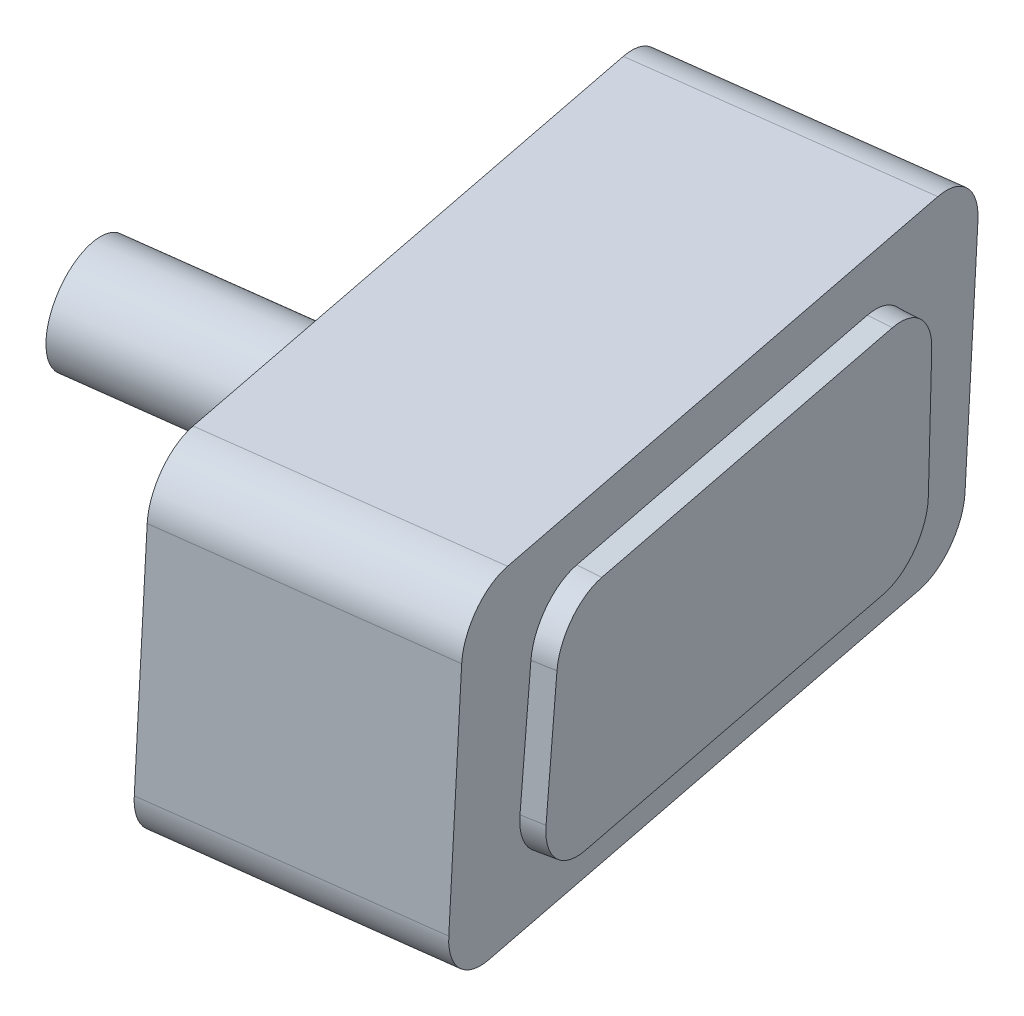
ISO-10303-21;
HEADER;
FILE_DESCRIPTION(('STEP AP214'),'2;1');
FILE_NAME('part.step','',(''),(''),'','','');
FILE_SCHEMA(('AUTOMOTIVE_DESIGN { 1 0 10303 214 1 1 1 1 }'));
ENDSEC;
DATA;
#1=APPLICATION_CONTEXT('core data for automotive mechanical design processes');
#2=APPLICATION_PROTOCOL_DEFINITION('international standard','automotive_design',2000,#1);
#3=PRODUCT_CONTEXT('',#1,'mechanical');
#4=PRODUCT('Part','Part','',(#3));
#5=PRODUCT_RELATED_PRODUCT_CATEGORY('part','',(#4));
#6=PRODUCT_DEFINITION_FORMATION('','',#4);
#7=PRODUCT_DEFINITION_CONTEXT('part definition',#1,'design');
#8=PRODUCT_DEFINITION('design','',#6,#7);
#9=PRODUCT_DEFINITION_SHAPE('','',#8);
#10=(LENGTH_UNIT() NAMED_UNIT(*) SI_UNIT(.MILLI.,.METRE.));
#11=(NAMED_UNIT(*) PLANE_ANGLE_UNIT() SI_UNIT($,.RADIAN.));
#12=(NAMED_UNIT(*) SI_UNIT($,.STERADIAN.) SOLID_ANGLE_UNIT());
#13=UNCERTAINTY_MEASURE_WITH_UNIT(LENGTH_MEASURE(1.E-05),#10,'distance_accuracy_value','');
#14=(GEOMETRIC_REPRESENTATION_CONTEXT(3) GLOBAL_UNCERTAINTY_ASSIGNED_CONTEXT((#13)) GLOBAL_UNIT_ASSIGNED_CONTEXT((#10,
#11,#12)) REPRESENTATION_CONTEXT('',''));
#15=CARTESIAN_POINT('',(0.,0.,0.));
#16=DIRECTION('',(0.,0.,1.));
#17=DIRECTION('',(1.,0.,0.));
#18=AXIS2_PLACEMENT_3D('',#15,#16,#17);
#19=CARTESIAN_POINT('',(-186.967647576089,90.0851409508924,-29.5540646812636));
#20=DIRECTION('',(-0.981314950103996,0.0523359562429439,0.185153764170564));
#21=DIRECTION('',(0.185407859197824,0.,0.982661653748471));
#22=AXIS2_PLACEMENT_3D('',#19,#20,#21);
#23=PLANE('',#22);
#24=CARTESIAN_POINT('',(-186.967647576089,90.0851409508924,-29.5540646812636));
#25=DIRECTION('',(-0.981314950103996,0.0523359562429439,0.185153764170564));
#26=DIRECTION('',(0.185407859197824,0.,0.982661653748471));
#27=AXIS2_PLACEMENT_3D('',#24,#25,#26);
#28=CIRCLE('',#27,9.99999999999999);
#29=CARTESIAN_POINT('',(-188.816557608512,90.1837479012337,-39.3811603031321));
#30=VERTEX_POINT('',#29);
#31=CARTESIAN_POINT('',(-187.500215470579,80.0993324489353,-29.5540646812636));
#32=VERTEX_POINT('',#31);
#33=EDGE_CURVE('E170',#30,#32,#28,.T.);
#34=ORIENTED_EDGE('',*,*,#33,.F.);
#35=DIRECTION('',(-0.0532567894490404,-0.998580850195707,0.));
#36=VECTOR('',#35,1.);
#37=CARTESIAN_POINT('',(-186.420002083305,135.11988616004,-39.3811603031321));
#38=LINE('',#37,#36);
#39=CARTESIAN_POINT('',(-186.420002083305,135.11988616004,-39.3811603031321));
#40=VERTEX_POINT('',#39);
#41=EDGE_CURVE('E216',#40,#30,#38,.T.);
#42=ORIENTED_EDGE('',*,*,#41,.F.);
#43=CARTESIAN_POINT('',(-184.571092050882,135.021279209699,-29.5540646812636));
#44=DIRECTION('',(-0.981314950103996,0.0523359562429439,0.185153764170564));
#45=DIRECTION('',(0.185407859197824,0.,0.982661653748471));
#46=AXIS2_PLACEMENT_3D('',#43,#44,#45);
#47=CIRCLE('',#46,10.);
#48=CARTESIAN_POINT('',(-184.038524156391,145.007087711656,-29.5540646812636));
#49=VERTEX_POINT('',#48);
#50=EDGE_CURVE('E240',#49,#40,#47,.T.);
#51=ORIENTED_EDGE('',*,*,#50,.F.);
#52=DIRECTION('',(-0.184891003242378,0.00986069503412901,-0.98270956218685));
#53=VECTOR('',#52,1.);
#54=CARTESIAN_POINT('',(-184.038524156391,145.007087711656,-29.5540646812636));
#55=LINE('',#54,#53);
#56=CARTESIAN_POINT('',(-165.549423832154,144.021018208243,68.7168915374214));
#57=VERTEX_POINT('',#56);
#58=EDGE_CURVE('E238',#57,#49,#55,.T.);
#59=ORIENTED_EDGE('',*,*,#58,.F.);
#60=CARTESIAN_POINT('',(-166.081991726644,134.035209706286,68.7168915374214));
#61=DIRECTION('',(-0.981314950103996,0.0523359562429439,0.185153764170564));
#62=DIRECTION('',(-0.185407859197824,0.,-0.982661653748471));
#63=AXIS2_PLACEMENT_3D('',#60,#61,#62);
#64=CIRCLE('',#63,10.);
#65=CARTESIAN_POINT('',(-164.23308169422,133.936602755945,78.5439871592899));
#66=VERTEX_POINT('',#65);
#67=EDGE_CURVE('E236',#66,#57,#64,.T.);
#68=ORIENTED_EDGE('',*,*,#67,.F.);
#69=DIRECTION('',(0.053256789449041,0.998580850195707,0.));
#70=VECTOR('',#69,1.);
#71=CARTESIAN_POINT('',(-164.23308169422,133.936602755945,78.5439871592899));
#72=LINE('',#71,#70);
#73=CARTESIAN_POINT('',(-166.629637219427,89.0004644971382,78.5439871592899));
#74=VERTEX_POINT('',#73);
#75=EDGE_CURVE('E234',#74,#66,#72,.T.);
#76=ORIENTED_EDGE('',*,*,#75,.F.);
#77=CARTESIAN_POINT('',(-168.478547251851,89.0990714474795,68.7168915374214));
#78=DIRECTION('',(-0.981314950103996,0.0523359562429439,0.185153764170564));
#79=DIRECTION('',(0.185407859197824,0.,0.982661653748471));
#80=AXIS2_PLACEMENT_3D('',#77,#78,#79);
#81=CIRCLE('',#80,9.99999999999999);
#82=CARTESIAN_POINT('',(-169.011115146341,79.1132629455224,68.7168915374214));
#83=VERTEX_POINT('',#82);
#84=EDGE_CURVE('E232',#83,#74,#81,.T.);
#85=ORIENTED_EDGE('',*,*,#84,.F.);
#86=DIRECTION('',(0.184891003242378,-0.00986069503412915,0.98270956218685));
#87=VECTOR('',#86,1.);
#88=CARTESIAN_POINT('',(-187.500215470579,80.0993324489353,-29.5540646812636));
#89=LINE('',#88,#87);
#90=EDGE_CURVE('E173',#32,#83,#89,.T.);
#91=ORIENTED_EDGE('',*,*,#90,.F.);
#92=EDGE_LOOP('',(#34,#42,#51,#59,#68,#76,#85,#91));
#93=FACE_BOUND('',#92,.T.);
#94=CARTESIAN_POINT('',(-182.195634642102,124.880378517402,-14.0976918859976));
#95=DIRECTION('',(0.981314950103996,-0.0523359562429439,-0.185153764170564));
#96=DIRECTION('',(-0.185407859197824,0.,-0.982661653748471));
#97=AXIS2_PLACEMENT_3D('',#94,#95,#96);
#98=CIRCLE('',#97,9.99999999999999);
#99=CARTESIAN_POINT('',(-184.024832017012,125.327425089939,-23.9188011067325));
#100=VERTEX_POINT('',#99);
#101=CARTESIAN_POINT('',(-181.663066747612,134.866187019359,-14.0976918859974));
#102=VERTEX_POINT('',#101);
#103=EDGE_CURVE('E178',#100,#102,#98,.T.);
#104=ORIENTED_EDGE('',*,*,#103,.F.);
#105=DIRECTION('',(0.0596769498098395,0.997628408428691,0.0342960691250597));
#106=VECTOR('',#105,1.);
#107=CARTESIAN_POINT('',(-185.517665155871,100.371512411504,-24.7767254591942));
#108=LINE('',#107,#106);
#109=CARTESIAN_POINT('',(-185.517665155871,100.371512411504,-24.7767254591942));
#110=VERTEX_POINT('',#109);
#111=EDGE_CURVE('E154',#110,#100,#108,.T.);
#112=ORIENTED_EDGE('',*,*,#111,.F.);
#113=CARTESIAN_POINT('',(-183.688467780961,99.924465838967,-14.9556162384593));
#114=DIRECTION('',(0.981314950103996,-0.0523359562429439,-0.185153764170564));
#115=DIRECTION('',(-0.185407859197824,0.,-0.982661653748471));
#116=AXIS2_PLACEMENT_3D('',#113,#114,#115);
#117=CIRCLE('',#116,10.);
#118=CARTESIAN_POINT('',(-184.221035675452,89.9386573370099,-14.9556162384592));
#119=VERTEX_POINT('',#118);
#120=EDGE_CURVE('E151',#119,#110,#117,.T.);
#121=ORIENTED_EDGE('',*,*,#120,.F.);
#122=DIRECTION('',(-0.184891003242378,0.00986069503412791,-0.98270956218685));
#123=VECTOR('',#122,1.);
#124=CARTESIAN_POINT('',(-171.41005015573,89.2554157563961,53.13573353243));
#125=LINE('',#124,#123);
#126=CARTESIAN_POINT('',(-171.41005015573,89.2554157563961,53.13573353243));
#127=VERTEX_POINT('',#126);
#128=EDGE_CURVE('E207',#127,#119,#125,.T.);
#129=ORIENTED_EDGE('',*,*,#128,.F.);
#130=CARTESIAN_POINT('',(-170.87748226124,99.2412242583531,53.1357335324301));
#131=DIRECTION('',(0.981314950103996,-0.0523359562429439,-0.185153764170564));
#132=DIRECTION('',(-0.185407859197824,0.,-0.982661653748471));
#133=AXIS2_PLACEMENT_3D('',#130,#131,#132);
#134=CIRCLE('',#133,9.9999999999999);
#135=CARTESIAN_POINT('',(-169.011112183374,99.4911770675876,62.9568427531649));
#136=VERTEX_POINT('',#135);
#137=EDGE_CURVE('E203',#136,#127,#134,.T.);
#138=ORIENTED_EDGE('',*,*,#137,.F.);
#139=DIRECTION('',(-0.0467717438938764,-0.998316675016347,0.0342960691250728));
#140=VECTOR('',#139,1.);
#141=CARTESIAN_POINT('',(-167.841105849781,124.464306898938,62.0989184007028));
#142=LINE('',#141,#140);
#143=CARTESIAN_POINT('',(-167.841105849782,124.464306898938,62.0989184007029));
#144=VERTEX_POINT('',#143);
#145=EDGE_CURVE('E199',#144,#136,#142,.T.);
#146=ORIENTED_EDGE('',*,*,#145,.F.);
#147=CARTESIAN_POINT('',(-169.707475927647,124.214354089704,52.277809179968));
#148=DIRECTION('',(0.981314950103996,-0.0523359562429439,-0.185153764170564));
#149=DIRECTION('',(-0.185407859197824,0.,-0.982661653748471));
#150=AXIS2_PLACEMENT_3D('',#147,#148,#149);
#151=CIRCLE('',#150,9.99999999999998);
#152=CARTESIAN_POINT('',(-169.174908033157,134.200162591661,52.2778091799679));
#153=VERTEX_POINT('',#152);
#154=EDGE_CURVE('E52',#153,#144,#151,.T.);
#155=ORIENTED_EDGE('',*,*,#154,.F.);
#156=DIRECTION('',(0.184891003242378,-0.00986069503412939,0.98270956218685));
#157=VECTOR('',#156,1.);
#158=CARTESIAN_POINT('',(-181.663066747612,134.866187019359,-14.0976918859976));
#159=LINE('',#158,#157);
#160=EDGE_CURVE('E47',#102,#153,#159,.T.);
#161=ORIENTED_EDGE('',*,*,#160,.F.);
#162=EDGE_LOOP('',(#104,#112,#121,#129,#138,#146,#155,#161));
#163=FACE_BOUND('',#162,.T.);
#164=ADVANCED_FACE('F32',(#93,#163),#23,.F.);
#165=CARTESIAN_POINT('',(-236.033395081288,92.7019387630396,-20.2963764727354));
#166=DIRECTION('',(0.981314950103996,-0.0523359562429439,-0.185153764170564));
#167=DIRECTION('',(-0.185407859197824,0.,-0.982661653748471));
#168=AXIS2_PLACEMENT_3D('',#165,#166,#167);
#169=CYLINDRICAL_SURFACE('',#168,9.99999999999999);
#170=ORIENTED_EDGE('',*,*,#33,.T.);
#171=DIRECTION('',(0.981314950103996,-0.0523359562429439,-0.185153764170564));
#172=VECTOR('',#171,1.);
#173=CARTESIAN_POINT('',(-236.565962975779,82.7161302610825,-20.2963764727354));
#174=LINE('',#173,#172);
#175=CARTESIAN_POINT('',(-236.565962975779,82.7161302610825,-20.2963764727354));
#176=VERTEX_POINT('',#175);
#177=EDGE_CURVE('E11',#176,#32,#174,.T.);
#178=ORIENTED_EDGE('',*,*,#177,.F.);
#179=CARTESIAN_POINT('',(-236.033395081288,92.7019387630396,-20.2963764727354));
#180=DIRECTION('',(-0.981314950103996,0.0523359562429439,0.185153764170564));
#181=DIRECTION('',(0.185407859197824,0.,0.982661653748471));
#182=AXIS2_PLACEMENT_3D('',#179,#180,#181);
#183=CIRCLE('',#182,9.99999999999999);
#184=CARTESIAN_POINT('',(-237.882305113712,92.8005457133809,-30.1234720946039));
#185=VERTEX_POINT('',#184);
#186=EDGE_CURVE('E212',#185,#176,#183,.T.);
#187=ORIENTED_EDGE('',*,*,#186,.F.);
#188=DIRECTION('',(0.981314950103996,-0.0523359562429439,-0.185153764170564));
#189=VECTOR('',#188,1.);
#190=CARTESIAN_POINT('',(-237.882305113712,92.8005457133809,-30.1234720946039));
#191=LINE('',#190,#189);
#192=EDGE_CURVE('E229',#185,#30,#191,.T.);
#193=ORIENTED_EDGE('',*,*,#192,.T.);
#194=EDGE_LOOP('',(#170,#178,#187,#193));
#195=FACE_BOUND('',#194,.T.);
#196=ADVANCED_FACE('F34',(#195),#169,.T.);
#197=CARTESIAN_POINT('',(-236.565962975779,82.7161302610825,-20.2963764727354));
#198=DIRECTION('',(0.0532567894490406,0.998580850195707,0.));
#199=DIRECTION('',(-0.998580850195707,0.0532567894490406,0.));
#200=AXIS2_PLACEMENT_3D('',#197,#198,#199);
#201=PLANE('',#200);
#202=ORIENTED_EDGE('',*,*,#90,.T.);
#203=DIRECTION('',(0.981314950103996,-0.0523359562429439,-0.185153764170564));
#204=VECTOR('',#203,1.);
#205=CARTESIAN_POINT('',(-218.076862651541,81.7300607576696,77.9745797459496));
#206=LINE('',#205,#204);
#207=CARTESIAN_POINT('',(-218.076862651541,81.7300607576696,77.9745797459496));
#208=VERTEX_POINT('',#207);
#209=EDGE_CURVE('E40',#208,#83,#206,.T.);
#210=ORIENTED_EDGE('',*,*,#209,.F.);
#211=DIRECTION('',(0.184891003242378,-0.00986069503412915,0.98270956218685));
#212=VECTOR('',#211,1.);
#213=CARTESIAN_POINT('',(-236.565962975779,82.7161302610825,-20.2963764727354));
#214=LINE('',#213,#212);
#215=EDGE_CURVE('E215',#176,#208,#214,.T.);
#216=ORIENTED_EDGE('',*,*,#215,.F.);
#217=ORIENTED_EDGE('',*,*,#177,.T.);
#218=EDGE_LOOP('',(#202,#210,#216,#217));
#219=FACE_BOUND('',#218,.T.);
#220=ADVANCED_FACE('F286',(#219),#201,.F.);
#221=CARTESIAN_POINT('',(-217.544294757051,91.7158692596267,77.9745797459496));
#222=DIRECTION('',(0.981314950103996,-0.0523359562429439,-0.185153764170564));
#223=DIRECTION('',(-0.185407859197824,0.,-0.982661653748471));
#224=AXIS2_PLACEMENT_3D('',#221,#222,#223);
#225=CYLINDRICAL_SURFACE('',#224,9.99999999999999);
#226=ORIENTED_EDGE('',*,*,#84,.T.);
#227=DIRECTION('',(0.981314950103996,-0.0523359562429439,-0.185153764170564));
#228=VECTOR('',#227,1.);
#229=CARTESIAN_POINT('',(-215.695384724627,91.6172623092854,87.8016753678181));
#230=LINE('',#229,#228);
#231=CARTESIAN_POINT('',(-215.695384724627,91.6172623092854,87.8016753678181));
#232=VERTEX_POINT('',#231);
#233=EDGE_CURVE('E257',#232,#74,#230,.T.);
#234=ORIENTED_EDGE('',*,*,#233,.F.);
#235=CARTESIAN_POINT('',(-217.544294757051,91.7158692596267,77.9745797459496));
#236=DIRECTION('',(-0.981314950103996,0.0523359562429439,0.185153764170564));
#237=DIRECTION('',(0.185407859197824,0.,0.982661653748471));
#238=AXIS2_PLACEMENT_3D('',#235,#236,#237);
#239=CIRCLE('',#238,9.99999999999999);
#240=EDGE_CURVE('E218',#208,#232,#239,.T.);
#241=ORIENTED_EDGE('',*,*,#240,.F.);
#242=ORIENTED_EDGE('',*,*,#209,.T.);
#243=EDGE_LOOP('',(#226,#234,#241,#242));
#244=FACE_BOUND('',#243,.T.);
#245=ADVANCED_FACE('F264',(#244),#225,.T.);
#246=CARTESIAN_POINT('',(-213.29882919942,136.553400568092,87.8016753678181));
#247=DIRECTION('',(-0.184891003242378,0.00986069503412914,-0.98270956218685));
#248=DIRECTION('',(-0.982757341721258,0.,0.184899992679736));
#249=AXIS2_PLACEMENT_3D('',#246,#247,#248);
#250=PLANE('',#249);
#251=ORIENTED_EDGE('',*,*,#75,.T.);
#252=DIRECTION('',(0.981314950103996,-0.0523359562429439,-0.185153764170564));
#253=VECTOR('',#252,1.);
#254=CARTESIAN_POINT('',(-213.29882919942,136.553400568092,87.8016753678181));
#255=LINE('',#254,#253);
#256=CARTESIAN_POINT('',(-213.29882919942,136.553400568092,87.8016753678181));
#257=VERTEX_POINT('',#256);
#258=EDGE_CURVE('E254',#257,#66,#255,.T.);
#259=ORIENTED_EDGE('',*,*,#258,.F.);
#260=DIRECTION('',(0.053256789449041,0.998580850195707,0.));
#261=VECTOR('',#260,1.);
#262=CARTESIAN_POINT('',(-213.29882919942,136.553400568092,87.8016753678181));
#263=LINE('',#262,#261);
#264=EDGE_CURVE('E220',#232,#257,#263,.T.);
#265=ORIENTED_EDGE('',*,*,#264,.F.);
#266=ORIENTED_EDGE('',*,*,#233,.T.);
#267=EDGE_LOOP('',(#251,#259,#265,#266));
#268=FACE_BOUND('',#267,.T.);
#269=ADVANCED_FACE('F274',(#268),#250,.F.);
#270=CARTESIAN_POINT('',(-215.147739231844,136.652007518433,77.9745797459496));
#271=DIRECTION('',(0.981314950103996,-0.0523359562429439,-0.185153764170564));
#272=DIRECTION('',(-0.185407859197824,0.,-0.982661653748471));
#273=AXIS2_PLACEMENT_3D('',#270,#271,#272);
#274=CYLINDRICAL_SURFACE('',#273,10.);
#275=ORIENTED_EDGE('',*,*,#67,.T.);
#276=DIRECTION('',(0.981314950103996,-0.0523359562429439,-0.185153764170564));
#277=VECTOR('',#276,1.);
#278=CARTESIAN_POINT('',(-214.615171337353,146.637816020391,77.9745797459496));
#279=LINE('',#278,#277);
#280=CARTESIAN_POINT('',(-214.615171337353,146.637816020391,77.9745797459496));
#281=VERTEX_POINT('',#280);
#282=EDGE_CURVE('E251',#281,#57,#279,.T.);
#283=ORIENTED_EDGE('',*,*,#282,.F.);
#284=CARTESIAN_POINT('',(-215.147739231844,136.652007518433,77.9745797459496));
#285=DIRECTION('',(-0.981314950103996,0.0523359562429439,0.185153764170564));
#286=DIRECTION('',(-0.185407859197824,0.,-0.982661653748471));
#287=AXIS2_PLACEMENT_3D('',#284,#285,#286);
#288=CIRCLE('',#287,10.);
#289=EDGE_CURVE('E222',#257,#281,#288,.T.);
#290=ORIENTED_EDGE('',*,*,#289,.F.);
#291=ORIENTED_EDGE('',*,*,#258,.T.);
#292=EDGE_LOOP('',(#275,#283,#290,#291));
#293=FACE_BOUND('',#292,.T.);
#294=ADVANCED_FACE('F278',(#293),#274,.T.);
#295=CARTESIAN_POINT('',(-233.104271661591,147.623885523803,-20.2963764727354));
#296=DIRECTION('',(-0.0532567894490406,-0.998580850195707,0.));
#297=DIRECTION('',(0.998580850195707,-0.0532567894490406,0.));
#298=AXIS2_PLACEMENT_3D('',#295,#296,#297);
#299=PLANE('',#298);
#300=ORIENTED_EDGE('',*,*,#58,.T.);
#301=DIRECTION('',(0.981314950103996,-0.0523359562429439,-0.185153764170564));
#302=VECTOR('',#301,1.);
#303=CARTESIAN_POINT('',(-233.104271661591,147.623885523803,-20.2963764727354));
#304=LINE('',#303,#302);
#305=CARTESIAN_POINT('',(-233.104271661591,147.623885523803,-20.2963764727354));
#306=VERTEX_POINT('',#305);
#307=EDGE_CURVE('E248',#306,#49,#304,.T.);
#308=ORIENTED_EDGE('',*,*,#307,.F.);
#309=DIRECTION('',(-0.184891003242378,0.00986069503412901,-0.98270956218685));
#310=VECTOR('',#309,1.);
#311=CARTESIAN_POINT('',(-233.104271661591,147.623885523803,-20.2963764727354));
#312=LINE('',#311,#310);
#313=EDGE_CURVE('E224',#281,#306,#312,.T.);
#314=ORIENTED_EDGE('',*,*,#313,.F.);
#315=ORIENTED_EDGE('',*,*,#282,.T.);
#316=EDGE_LOOP('',(#300,#308,#314,#315));
#317=FACE_BOUND('',#316,.T.);
#318=ADVANCED_FACE('F299',(#317),#299,.F.);
#319=CARTESIAN_POINT('',(-233.636839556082,137.638077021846,-20.2963764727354));
#320=DIRECTION('',(0.981314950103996,-0.0523359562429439,-0.185153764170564));
#321=DIRECTION('',(-0.185407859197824,0.,-0.982661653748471));
#322=AXIS2_PLACEMENT_3D('',#319,#320,#321);
#323=CYLINDRICAL_SURFACE('',#322,10.);
#324=ORIENTED_EDGE('',*,*,#50,.T.);
#325=DIRECTION('',(0.981314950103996,-0.0523359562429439,-0.185153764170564));
#326=VECTOR('',#325,1.);
#327=CARTESIAN_POINT('',(-235.485749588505,137.736683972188,-30.1234720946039));
#328=LINE('',#327,#326);
#329=CARTESIAN_POINT('',(-235.485749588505,137.736683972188,-30.1234720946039));
#330=VERTEX_POINT('',#329);
#331=EDGE_CURVE('E245',#330,#40,#328,.T.);
#332=ORIENTED_EDGE('',*,*,#331,.F.);
#333=CARTESIAN_POINT('',(-233.636839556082,137.638077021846,-20.2963764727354));
#334=DIRECTION('',(-0.981314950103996,0.0523359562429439,0.185153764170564));
#335=DIRECTION('',(0.185407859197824,0.,0.982661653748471));
#336=AXIS2_PLACEMENT_3D('',#333,#334,#335);
#337=CIRCLE('',#336,10.);
#338=EDGE_CURVE('E226',#306,#330,#337,.T.);
#339=ORIENTED_EDGE('',*,*,#338,.F.);
#340=ORIENTED_EDGE('',*,*,#307,.T.);
#341=EDGE_LOOP('',(#324,#332,#339,#340));
#342=FACE_BOUND('',#341,.T.);
#343=ADVANCED_FACE('F297',(#342),#323,.T.);
#344=CARTESIAN_POINT('',(-235.485749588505,137.736683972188,-30.1234720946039));
#345=DIRECTION('',(0.184891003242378,-0.00986069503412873,0.98270956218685));
#346=DIRECTION('',(0.982757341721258,0.,-0.184899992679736));
#347=AXIS2_PLACEMENT_3D('',#344,#345,#346);
#348=PLANE('',#347);
#349=ORIENTED_EDGE('',*,*,#41,.T.);
#350=ORIENTED_EDGE('',*,*,#192,.F.);
#351=DIRECTION('',(-0.0532567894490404,-0.998580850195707,0.));
#352=VECTOR('',#351,1.);
#353=CARTESIAN_POINT('',(-235.485749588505,137.736683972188,-30.1234720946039));
#354=LINE('',#353,#352);
#355=EDGE_CURVE('E228',#330,#185,#354,.T.);
#356=ORIENTED_EDGE('',*,*,#355,.F.);
#357=ORIENTED_EDGE('',*,*,#331,.T.);
#358=EDGE_LOOP('',(#349,#350,#356,#357));
#359=FACE_BOUND('',#358,.T.);
#360=ADVANCED_FACE('F292',(#359),#348,.F.);
#361=CARTESIAN_POINT('',(-236.033395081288,92.7019387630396,-20.2963764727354));
#362=DIRECTION('',(-0.981314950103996,0.0523359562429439,0.185153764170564));
#363=DIRECTION('',(0.185407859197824,0.,0.982661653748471));
#364=AXIS2_PLACEMENT_3D('',#361,#362,#363);
#365=PLANE('',#364);
#366=CARTESIAN_POINT('',(-225.902382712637,113.03671985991,27.6501166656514));
#367=DIRECTION('',(-0.981314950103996,0.0523359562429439,0.185153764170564));
#368=DIRECTION('',(0.185407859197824,0.,0.982661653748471));
#369=AXIS2_PLACEMENT_3D('',#366,#367,#368);
#370=CIRCLE('',#369,9.99999999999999);
#371=CARTESIAN_POINT('',(-224.048304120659,113.03671985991,37.4767332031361));
#372=VERTEX_POINT('',#371);
#373=EDGE_CURVE('E330',#372,#372,#370,.T.);
#374=ORIENTED_EDGE('',*,*,#373,.F.);
#375=EDGE_LOOP('',(#374));
#376=FACE_BOUND('',#375,.T.);
#377=ORIENTED_EDGE('',*,*,#186,.T.);
#378=ORIENTED_EDGE('',*,*,#215,.T.);
#379=ORIENTED_EDGE('',*,*,#240,.T.);
#380=ORIENTED_EDGE('',*,*,#264,.T.);
#381=ORIENTED_EDGE('',*,*,#289,.T.);
#382=ORIENTED_EDGE('',*,*,#313,.T.);
#383=ORIENTED_EDGE('',*,*,#338,.T.);
#384=ORIENTED_EDGE('',*,*,#355,.T.);
#385=EDGE_LOOP('',(#377,#378,#379,#380,#381,#382,#383,#384));
#386=FACE_BOUND('',#385,.T.);
#387=ADVANCED_FACE('F282',(#376,#386),#365,.T.);
#388=CARTESIAN_POINT('',(-182.195634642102,124.880378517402,-14.0976918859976));
#389=DIRECTION('',(-0.981314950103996,0.0523359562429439,0.185153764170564));
#390=DIRECTION('',(-0.185407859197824,0.,-0.982661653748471));
#391=AXIS2_PLACEMENT_3D('',#388,#389,#390);
#392=CONICAL_SURFACE('',#391,9.99999999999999,0.05235987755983);
#393=CARTESIAN_POINT('',(-178.270374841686,124.67103469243,-14.8383069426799));
#394=DIRECTION('',(-0.981314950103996,0.0523359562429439,0.185153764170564));
#395=DIRECTION('',(0.185407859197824,0.,0.982661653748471));
#396=AXIS2_PLACEMENT_3D('',#393,#394,#395);
#397=CIRCLE('',#396,9.79036888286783);
#398=CARTESIAN_POINT('',(-180.06122654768,125.108709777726,-24.4535351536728));
#399=VERTEX_POINT('',#398);
#400=CARTESIAN_POINT('',(-177.748971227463,134.447509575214,-14.8383069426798));
#401=VERTEX_POINT('',#400);
#402=EDGE_CURVE('E164',#399,#401,#397,.F.);
#403=ORIENTED_EDGE('',*,*,#402,.F.);
#404=DIRECTION('',(-0.989543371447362,0.0546038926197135,0.133500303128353));
#405=VECTOR('',#404,1.);
#406=CARTESIAN_POINT('',(-184.024832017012,125.327425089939,-23.9188011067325));
#407=LINE('',#406,#405);
#408=EDGE_CURVE('E160',#399,#100,#407,.T.);
#409=ORIENTED_EDGE('',*,*,#408,.T.);
#410=ORIENTED_EDGE('',*,*,#103,.T.);
#411=DIRECTION('',(-0.977182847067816,0.104525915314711,0.184900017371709));
#412=VECTOR('',#411,1.);
#413=CARTESIAN_POINT('',(-181.663066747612,134.866187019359,-14.0976918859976));
#414=LINE('',#413,#412);
#415=EDGE_CURVE('E192',#401,#102,#414,.T.);
#416=ORIENTED_EDGE('',*,*,#415,.F.);
#417=EDGE_LOOP('',(#403,#409,#410,#416));
#418=FACE_BOUND('',#417,.T.);
#419=ADVANCED_FACE('F320',(#418),#392,.T.);
#420=CARTESIAN_POINT('',(-181.663066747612,134.866187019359,-14.0976918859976));
#421=DIRECTION('',(0.104541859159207,0.994473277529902,-0.00969019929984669));
#422=DIRECTION('',(-0.994519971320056,0.104546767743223,0.));
#423=AXIS2_PLACEMENT_3D('',#420,#421,#422);
#424=PLANE('',#423);
#425=DIRECTION('',(0.184891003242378,-0.0098606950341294,0.98270956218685));
#426=VECTOR('',#425,1.);
#427=CARTESIAN_POINT('',(-177.748971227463,134.447509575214,-14.8383069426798));
#428=LINE('',#427,#426);
#429=CARTESIAN_POINT('',(-165.260812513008,133.781485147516,51.5371941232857));
#430=VERTEX_POINT('',#429);
#431=EDGE_CURVE('E188',#401,#430,#428,.T.);
#432=ORIENTED_EDGE('',*,*,#431,.F.);
#433=ORIENTED_EDGE('',*,*,#415,.T.);
#434=ORIENTED_EDGE('',*,*,#160,.T.);
#435=DIRECTION('',(-0.977182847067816,0.104525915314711,0.184900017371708));
#436=VECTOR('',#435,1.);
#437=CARTESIAN_POINT('',(-169.174908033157,134.200162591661,52.2778091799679));
#438=LINE('',#437,#436);
#439=EDGE_CURVE('E194',#430,#153,#438,.T.);
#440=ORIENTED_EDGE('',*,*,#439,.F.);
#441=EDGE_LOOP('',(#432,#433,#434,#440));
#442=FACE_BOUND('',#441,.T.);
#443=ADVANCED_FACE('F325',(#442),#424,.T.);
#444=CARTESIAN_POINT('',(-169.707475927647,124.214354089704,52.277809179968));
#445=DIRECTION('',(-0.981314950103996,0.0523359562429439,0.185153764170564));
#446=DIRECTION('',(-0.185407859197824,0.,-0.982661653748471));
#447=AXIS2_PLACEMENT_3D('',#444,#445,#446);
#448=CONICAL_SURFACE('',#447,9.99999999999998,0.05235987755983);
#449=CARTESIAN_POINT('',(-165.782216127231,124.005010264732,51.5371941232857));
#450=DIRECTION('',(-0.981314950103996,0.0523359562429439,0.185153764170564));
#451=DIRECTION('',(0.185407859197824,0.,0.982661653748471));
#452=AXIS2_PLACEMENT_3D('',#449,#450,#451);
#453=CIRCLE('',#452,9.79036888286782);
#454=CARTESIAN_POINT('',(-163.954970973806,124.249723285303,61.1524223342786));
#455=VERTEX_POINT('',#454);
#456=EDGE_CURVE('E185',#430,#455,#453,.F.);
#457=ORIENTED_EDGE('',*,*,#456,.F.);
#458=ORIENTED_EDGE('',*,*,#439,.T.);
#459=ORIENTED_EDGE('',*,*,#154,.T.);
#460=DIRECTION('',(-0.97020226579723,0.0535723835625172,0.236299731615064));
#461=VECTOR('',#460,1.);
#462=CARTESIAN_POINT('',(-167.841105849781,124.464306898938,62.0989184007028));
#463=LINE('',#462,#461);
#464=EDGE_CURVE('E196',#455,#144,#463,.T.);
#465=ORIENTED_EDGE('',*,*,#464,.F.);
#466=EDGE_LOOP('',(#457,#458,#459,#465));
#467=FACE_BOUND('',#466,.T.);
#468=ADVANCED_FACE('F358',(#467),#448,.T.);
#469=CARTESIAN_POINT('',(-167.841105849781,124.464306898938,62.0989184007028));
#470=DIRECTION('',(0.237739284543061,0.0222219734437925,0.971074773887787));
#471=DIRECTION('',(0.971314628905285,0.,-0.237798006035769));
#472=AXIS2_PLACEMENT_3D('',#469,#470,#471);
#473=PLANE('',#472);
#474=DIRECTION('',(-0.0467717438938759,-0.998316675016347,0.0342960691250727));
#475=VECTOR('',#474,1.);
#476=CARTESIAN_POINT('',(-163.954970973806,124.249723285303,61.1524223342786));
#477=LINE('',#476,#475);
#478=CARTESIAN_POINT('',(-165.124977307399,99.2765934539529,62.0103466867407));
#479=VERTEX_POINT('',#478);
#480=EDGE_CURVE('E182',#455,#479,#477,.T.);
#481=ORIENTED_EDGE('',*,*,#480,.F.);
#482=ORIENTED_EDGE('',*,*,#464,.T.);
#483=ORIENTED_EDGE('',*,*,#145,.T.);
#484=DIRECTION('',(-0.97020226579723,0.0535723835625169,0.236299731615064));
#485=VECTOR('',#484,1.);
#486=CARTESIAN_POINT('',(-169.011112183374,99.4911770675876,62.9568427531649));
#487=LINE('',#486,#485);
#488=EDGE_CURVE('E200',#479,#136,#487,.T.);
#489=ORIENTED_EDGE('',*,*,#488,.F.);
#490=EDGE_LOOP('',(#481,#482,#483,#489));
#491=FACE_BOUND('',#490,.T.);
#492=ADVANCED_FACE('F356',(#491),#473,.T.);
#493=CARTESIAN_POINT('',(-170.87748226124,99.2412242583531,53.1357335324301));
#494=DIRECTION('',(-0.981314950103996,0.0523359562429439,0.185153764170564));
#495=DIRECTION('',(-0.185407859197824,0.,-0.982661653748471));
#496=AXIS2_PLACEMENT_3D('',#493,#494,#495);
#497=CONICAL_SURFACE('',#496,9.9999999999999,0.05235987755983);
#498=CARTESIAN_POINT('',(-166.952222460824,99.0318804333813,52.3951184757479));
#499=DIRECTION('',(-0.981314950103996,0.0523359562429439,0.185153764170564));
#500=DIRECTION('',(0.185407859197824,0.,0.982661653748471));
#501=AXIS2_PLACEMENT_3D('',#498,#499,#500);
#502=CIRCLE('',#501,9.79036888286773);
#503=CARTESIAN_POINT('',(-167.473626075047,89.2554055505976,52.3951184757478));
#504=VERTEX_POINT('',#503);
#505=EDGE_CURVE('E175',#479,#504,#502,.F.);
#506=ORIENTED_EDGE('',*,*,#505,.F.);
#507=ORIENTED_EDGE('',*,*,#488,.T.);
#508=ORIENTED_EDGE('',*,*,#137,.T.);
#509=DIRECTION('',(-0.982757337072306,2.54795294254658E-06,0.184900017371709));
#510=VECTOR('',#509,1.);
#511=CARTESIAN_POINT('',(-171.41005015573,89.2554157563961,53.13573353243));
#512=LINE('',#511,#510);
#513=EDGE_CURVE('E204',#504,#127,#512,.T.);
#514=ORIENTED_EDGE('',*,*,#513,.F.);
#515=EDGE_LOOP('',(#506,#507,#508,#514));
#516=FACE_BOUND('',#515,.T.);
#517=ADVANCED_FACE('F352',(#516),#497,.T.);
#518=CARTESIAN_POINT('',(-171.41005015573,89.2554157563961,53.13573353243));
#519=DIRECTION('',(-0.00182574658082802,-0.999951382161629,-0.00969019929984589));
#520=DIRECTION('',(0.,0.00969021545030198,-0.999953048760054));
#521=AXIS2_PLACEMENT_3D('',#518,#519,#520);
#522=PLANE('',#521);
#523=DIRECTION('',(-0.184891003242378,0.0098606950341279,-0.98270956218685));
#524=VECTOR('',#523,1.);
#525=CARTESIAN_POINT('',(-167.473626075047,89.2554055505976,52.3951184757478));
#526=LINE('',#525,#524);
#527=CARTESIAN_POINT('',(-180.284611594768,89.9386471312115,-15.6962312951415));
#528=VERTEX_POINT('',#527);
#529=EDGE_CURVE('E169',#504,#528,#526,.T.);
#530=ORIENTED_EDGE('',*,*,#529,.F.);
#531=ORIENTED_EDGE('',*,*,#513,.T.);
#532=ORIENTED_EDGE('',*,*,#128,.T.);
#533=DIRECTION('',(-0.982757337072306,2.54795294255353E-06,0.184900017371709));
#534=VECTOR('',#533,1.);
#535=CARTESIAN_POINT('',(-184.221035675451,89.9386573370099,-14.9556162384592));
#536=LINE('',#535,#534);
#537=EDGE_CURVE('E208',#528,#119,#536,.T.);
#538=ORIENTED_EDGE('',*,*,#537,.F.);
#539=EDGE_LOOP('',(#530,#531,#532,#538));
#540=FACE_BOUND('',#539,.T.);
#541=ADVANCED_FACE('F349',(#540),#522,.T.);
#542=CARTESIAN_POINT('',(-183.688467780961,99.924465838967,-14.9556162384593));
#543=DIRECTION('',(-0.981314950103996,0.0523359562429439,0.185153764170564));
#544=DIRECTION('',(-0.185407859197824,0.,-0.982661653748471));
#545=AXIS2_PLACEMENT_3D('',#542,#543,#544);
#546=CONICAL_SURFACE('',#545,10.,0.05235987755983);
#547=CARTESIAN_POINT('',(-179.763207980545,99.7151220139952,-15.6962312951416));
#548=DIRECTION('',(-0.981314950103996,0.0523359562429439,0.185153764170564));
#549=DIRECTION('',(0.185407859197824,0.,0.982661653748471));
#550=AXIS2_PLACEMENT_3D('',#547,#548,#549);
#551=CIRCLE('',#550,9.79036888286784);
#552=CARTESIAN_POINT('',(-181.55405968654,100.152797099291,-25.3114595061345));
#553=VERTEX_POINT('',#552);
#554=EDGE_CURVE('E149',#528,#553,#551,.F.);
#555=ORIENTED_EDGE('',*,*,#554,.F.);
#556=ORIENTED_EDGE('',*,*,#537,.T.);
#557=ORIENTED_EDGE('',*,*,#120,.T.);
#558=DIRECTION('',(-0.989543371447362,0.0546038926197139,0.133500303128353));
#559=VECTOR('',#558,1.);
#560=CARTESIAN_POINT('',(-185.517665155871,100.371512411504,-24.7767254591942));
#561=LINE('',#560,#559);
#562=EDGE_CURVE('E144',#553,#110,#561,.T.);
#563=ORIENTED_EDGE('',*,*,#562,.F.);
#564=EDGE_LOOP('',(#555,#556,#557,#563));
#565=FACE_BOUND('',#564,.T.);
#566=ADVANCED_FACE('F146',(#565),#546,.T.);
#567=CARTESIAN_POINT('',(-185.517665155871,100.371512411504,-24.7767254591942));
#568=DIRECTION('',(-0.131310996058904,0.0419043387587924,-0.990455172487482));
#569=DIRECTION('',(-0.991325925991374,0.,0.131426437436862));
#570=AXIS2_PLACEMENT_3D('',#567,#568,#569);
#571=PLANE('',#570);
#572=DIRECTION('',(0.0596769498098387,0.997628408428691,0.0342960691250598));
#573=VECTOR('',#572,1.);
#574=CARTESIAN_POINT('',(-181.55405968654,100.152797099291,-25.3114595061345));
#575=LINE('',#574,#573);
#576=EDGE_CURVE('E157',#553,#399,#575,.T.);
#577=ORIENTED_EDGE('',*,*,#576,.F.);
#578=ORIENTED_EDGE('',*,*,#562,.T.);
#579=ORIENTED_EDGE('',*,*,#111,.T.);
#580=ORIENTED_EDGE('',*,*,#408,.F.);
#581=EDGE_LOOP('',(#577,#578,#579,#580));
#582=FACE_BOUND('',#581,.T.);
#583=ADVANCED_FACE('F158',(#582),#571,.T.);
#584=CARTESIAN_POINT('',(-190.933671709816,24.7906561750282,-53.72138040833));
#585=DIRECTION('',(-0.981314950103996,0.0523359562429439,0.185153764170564));
#586=DIRECTION('',(0.185407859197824,0.,0.982661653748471));
#587=AXIS2_PLACEMENT_3D('',#584,#585,#586);
#588=PLANE('',#587);
#589=ORIENTED_EDGE('',*,*,#576,.T.);
#590=ORIENTED_EDGE('',*,*,#402,.T.);
#591=ORIENTED_EDGE('',*,*,#431,.T.);
#592=ORIENTED_EDGE('',*,*,#456,.T.);
#593=ORIENTED_EDGE('',*,*,#480,.T.);
#594=ORIENTED_EDGE('',*,*,#505,.T.);
#595=ORIENTED_EDGE('',*,*,#529,.T.);
#596=ORIENTED_EDGE('',*,*,#554,.T.);
#597=EDGE_LOOP('',(#589,#590,#591,#592,#593,#594,#595,#596));
#598=FACE_BOUND('',#597,.T.);
#599=ADVANCED_FACE('F167',(#598),#588,.F.);
#600=CARTESIAN_POINT('',(-274.968130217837,115.653517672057,36.9078048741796));
#601=DIRECTION('',(0.981314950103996,-0.0523359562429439,-0.185153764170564));
#602=DIRECTION('',(-0.185407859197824,0.,-0.982661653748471));
#603=AXIS2_PLACEMENT_3D('',#600,#601,#602);
#604=CYLINDRICAL_SURFACE('',#603,9.99999999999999);
#605=CARTESIAN_POINT('',(-274.968130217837,115.653517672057,36.9078048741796));
#606=DIRECTION('',(-0.981314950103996,0.0523359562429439,0.185153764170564));
#607=DIRECTION('',(0.185407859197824,0.,0.982661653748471));
#608=AXIS2_PLACEMENT_3D('',#605,#606,#607);
#609=CIRCLE('',#608,9.99999999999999);
#610=CARTESIAN_POINT('',(-273.114051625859,115.653517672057,46.7344214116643));
#611=VERTEX_POINT('',#610);
#612=EDGE_CURVE('E211',#611,#611,#609,.T.);
#613=ORIENTED_EDGE('',*,*,#612,.F.);
#614=EDGE_LOOP('',(#613));
#615=FACE_BOUND('',#614,.T.);
#616=ORIENTED_EDGE('',*,*,#373,.T.);
#617=EDGE_LOOP('',(#616));
#618=FACE_BOUND('',#617,.T.);
#619=ADVANCED_FACE('F369',(#615,#618),#604,.T.);
#620=CARTESIAN_POINT('',(-274.968130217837,115.653517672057,36.9078048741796));
#621=DIRECTION('',(-0.981314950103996,0.0523359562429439,0.185153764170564));
#622=DIRECTION('',(0.185407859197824,0.,0.982661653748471));
#623=AXIS2_PLACEMENT_3D('',#620,#621,#622);
#624=PLANE('',#623);
#625=ORIENTED_EDGE('',*,*,#612,.T.);
#626=EDGE_LOOP('',(#625));
#627=FACE_BOUND('',#626,.T.);
#628=ADVANCED_FACE('F374',(#627),#624,.T.);
#629=CLOSED_SHELL('',(#164,#196,#220,#245,#269,#294,#318,#343,#360,#387,#419,#443,#468,#492,
#517,#541,#566,#583,#599,#619,#628));
#630=MANIFOLD_SOLID_BREP('B2',#629);
#631=ADVANCED_BREP_SHAPE_REPRESENTATION('',(#18,#630),#14);
#632=SHAPE_DEFINITION_REPRESENTATION(#9,#631);
ENDSEC;
END-ISO-10303-21;
